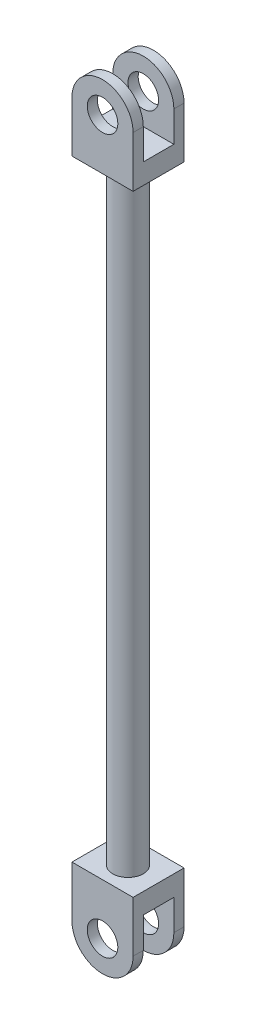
ISO-10303-21;
HEADER;
FILE_DESCRIPTION(('STEP AP214'),'2;1');
FILE_NAME('part.step','',(''),(''),'','','');
FILE_SCHEMA(('AUTOMOTIVE_DESIGN { 1 0 10303 214 1 1 1 1 }'));
ENDSEC;
DATA;
#1=APPLICATION_CONTEXT('core data for automotive mechanical design processes');
#2=APPLICATION_PROTOCOL_DEFINITION('international standard','automotive_design',2000,#1);
#3=PRODUCT_CONTEXT('',#1,'mechanical');
#4=PRODUCT('Part','Part','',(#3));
#5=PRODUCT_RELATED_PRODUCT_CATEGORY('part','',(#4));
#6=PRODUCT_DEFINITION_FORMATION('','',#4);
#7=PRODUCT_DEFINITION_CONTEXT('part definition',#1,'design');
#8=PRODUCT_DEFINITION('design','',#6,#7);
#9=PRODUCT_DEFINITION_SHAPE('','',#8);
#10=(LENGTH_UNIT() NAMED_UNIT(*) SI_UNIT(.MILLI.,.METRE.));
#11=(NAMED_UNIT(*) PLANE_ANGLE_UNIT() SI_UNIT($,.RADIAN.));
#12=(NAMED_UNIT(*) SI_UNIT($,.STERADIAN.) SOLID_ANGLE_UNIT());
#13=UNCERTAINTY_MEASURE_WITH_UNIT(LENGTH_MEASURE(1.E-05),#10,'distance_accuracy_value','');
#14=(GEOMETRIC_REPRESENTATION_CONTEXT(3) GLOBAL_UNCERTAINTY_ASSIGNED_CONTEXT((#13)) GLOBAL_UNIT_ASSIGNED_CONTEXT((#10,
#11,#12)) REPRESENTATION_CONTEXT('',''));
#15=CARTESIAN_POINT('',(0.,0.,0.));
#16=DIRECTION('',(0.,0.,1.));
#17=DIRECTION('',(1.,0.,0.));
#18=AXIS2_PLACEMENT_3D('',#15,#16,#17);
#19=CARTESIAN_POINT('',(0.,0.,1.));
#20=DIRECTION('',(0.,0.,-1.));
#21=DIRECTION('',(-1.,0.,0.));
#22=AXIS2_PLACEMENT_3D('',#19,#20,#21);
#23=CYLINDRICAL_SURFACE('',#22,3.);
#24=CARTESIAN_POINT('',(0.,0.,0.));
#25=DIRECTION('',(0.,0.,1.));
#26=DIRECTION('',(1.,0.,0.));
#27=AXIS2_PLACEMENT_3D('',#24,#25,#26);
#28=CIRCLE('',#27,3.);
#29=CARTESIAN_POINT('',(3.,0.,0.));
#30=VERTEX_POINT('',#29);
#31=CARTESIAN_POINT('',(-3.,0.,0.));
#32=VERTEX_POINT('',#31);
#33=EDGE_CURVE('E291',#30,#32,#28,.T.);
#34=ORIENTED_EDGE('',*,*,#33,.T.);
#35=DIRECTION('',(0.,0.,-1.));
#36=VECTOR('',#35,1.);
#37=CARTESIAN_POINT('',(-3.,0.,1.));
#38=LINE('',#37,#36);
#39=CARTESIAN_POINT('',(-3.,0.,1.));
#40=VERTEX_POINT('',#39);
#41=EDGE_CURVE('E243',#40,#32,#38,.T.);
#42=ORIENTED_EDGE('',*,*,#41,.F.);
#43=CARTESIAN_POINT('',(0.,0.,1.));
#44=DIRECTION('',(0.,0.,1.));
#45=DIRECTION('',(1.,0.,0.));
#46=AXIS2_PLACEMENT_3D('',#43,#44,#45);
#47=CIRCLE('',#46,3.);
#48=CARTESIAN_POINT('',(3.,0.,1.));
#49=VERTEX_POINT('',#48);
#50=EDGE_CURVE('E292',#49,#40,#47,.T.);
#51=ORIENTED_EDGE('',*,*,#50,.F.);
#52=DIRECTION('',(0.,0.,-1.));
#53=VECTOR('',#52,1.);
#54=CARTESIAN_POINT('',(3.,0.,1.));
#55=LINE('',#54,#53);
#56=EDGE_CURVE('E306',#49,#30,#55,.T.);
#57=ORIENTED_EDGE('',*,*,#56,.T.);
#58=EDGE_LOOP('',(#34,#42,#51,#57));
#59=FACE_BOUND('',#58,.T.);
#60=ADVANCED_FACE('F45',(#59),#23,.T.);
#61=CARTESIAN_POINT('',(-3.,0.,1.));
#62=DIRECTION('',(1.,0.,0.));
#63=DIRECTION('',(0.,1.,0.));
#64=AXIS2_PLACEMENT_3D('',#61,#62,#63);
#65=PLANE('',#64);
#66=DIRECTION('',(0.,-1.,0.));
#67=VECTOR('',#66,1.);
#68=CARTESIAN_POINT('',(-3.,0.,0.));
#69=LINE('',#68,#67);
#70=CARTESIAN_POINT('',(-3.,-3.,0.));
#71=VERTEX_POINT('',#70);
#72=EDGE_CURVE('E310',#32,#71,#69,.T.);
#73=ORIENTED_EDGE('',*,*,#72,.T.);
#74=DIRECTION('',(0.,0.,1.));
#75=VECTOR('',#74,1.);
#76=CARTESIAN_POINT('',(-3.,-3.,-3.));
#77=LINE('',#76,#75);
#78=CARTESIAN_POINT('',(-3.,-3.,-3.));
#79=VERTEX_POINT('',#78);
#80=EDGE_CURVE('E282',#79,#71,#77,.T.);
#81=ORIENTED_EDGE('',*,*,#80,.F.);
#82=DIRECTION('',(0.,1.,0.));
#83=VECTOR('',#82,1.);
#84=CARTESIAN_POINT('',(-3.,-5.,-3.));
#85=LINE('',#84,#83);
#86=CARTESIAN_POINT('',(-3.,0.,-3.));
#87=VERTEX_POINT('',#86);
#88=EDGE_CURVE('E249',#79,#87,#85,.T.);
#89=ORIENTED_EDGE('',*,*,#88,.T.);
#90=DIRECTION('',(0.,0.,1.));
#91=VECTOR('',#90,1.);
#92=CARTESIAN_POINT('',(-3.,0.,-4.));
#93=LINE('',#92,#91);
#94=CARTESIAN_POINT('',(-3.,0.,-4.));
#95=VERTEX_POINT('',#94);
#96=EDGE_CURVE('E260',#95,#87,#93,.T.);
#97=ORIENTED_EDGE('',*,*,#96,.F.);
#98=DIRECTION('',(0.,1.,0.));
#99=VECTOR('',#98,1.);
#100=CARTESIAN_POINT('',(-3.,-5.,-4.));
#101=LINE('',#100,#99);
#102=CARTESIAN_POINT('',(-3.,-5.,-4.));
#103=VERTEX_POINT('',#102);
#104=EDGE_CURVE('E257',#103,#95,#101,.T.);
#105=ORIENTED_EDGE('',*,*,#104,.F.);
#106=DIRECTION('',(0.,0.,-1.));
#107=VECTOR('',#106,1.);
#108=CARTESIAN_POINT('',(-3.,-5.,1.));
#109=LINE('',#108,#107);
#110=CARTESIAN_POINT('',(-3.,-5.,1.));
#111=VERTEX_POINT('',#110);
#112=EDGE_CURVE('E322',#111,#103,#109,.T.);
#113=ORIENTED_EDGE('',*,*,#112,.F.);
#114=DIRECTION('',(0.,-1.,0.));
#115=VECTOR('',#114,1.);
#116=CARTESIAN_POINT('',(-3.,0.,1.));
#117=LINE('',#116,#115);
#118=EDGE_CURVE('E296',#40,#111,#117,.T.);
#119=ORIENTED_EDGE('',*,*,#118,.F.);
#120=ORIENTED_EDGE('',*,*,#41,.T.);
#121=EDGE_LOOP('',(#73,#81,#89,#97,#105,#113,#119,#120));
#122=FACE_BOUND('',#121,.T.);
#123=ADVANCED_FACE('F448',(#122),#65,.F.);
#124=CARTESIAN_POINT('',(-3.,-5.,1.));
#125=DIRECTION('',(0.,1.,0.));
#126=DIRECTION('',(0.,0.,1.));
#127=AXIS2_PLACEMENT_3D('',#124,#125,#126);
#128=PLANE('',#127);
#129=CARTESIAN_POINT('',(0.,-5.,-1.5));
#130=DIRECTION('',(0.,-1.,0.));
#131=DIRECTION('',(0.,0.,-1.));
#132=AXIS2_PLACEMENT_3D('',#129,#130,#131);
#133=CIRCLE('',#132,1.5);
#134=CARTESIAN_POINT('',(0.,-5.,-3.));
#135=VERTEX_POINT('',#134);
#136=EDGE_CURVE('E238',#135,#135,#133,.T.);
#137=ORIENTED_EDGE('',*,*,#136,.F.);
#138=EDGE_LOOP('',(#137));
#139=FACE_BOUND('',#138,.T.);
#140=ORIENTED_EDGE('',*,*,#112,.T.);
#141=DIRECTION('',(-1.,0.,0.));
#142=VECTOR('',#141,1.);
#143=CARTESIAN_POINT('',(3.,-5.,-4.));
#144=LINE('',#143,#142);
#145=CARTESIAN_POINT('',(3.,-5.,-4.));
#146=VERTEX_POINT('',#145);
#147=EDGE_CURVE('E253',#146,#103,#144,.T.);
#148=ORIENTED_EDGE('',*,*,#147,.F.);
#149=DIRECTION('',(0.,0.,-1.));
#150=VECTOR('',#149,1.);
#151=CARTESIAN_POINT('',(3.,-5.,1.));
#152=LINE('',#151,#150);
#153=CARTESIAN_POINT('',(3.,-5.,1.));
#154=VERTEX_POINT('',#153);
#155=EDGE_CURVE('E319',#154,#146,#152,.T.);
#156=ORIENTED_EDGE('',*,*,#155,.F.);
#157=DIRECTION('',(1.,0.,0.));
#158=VECTOR('',#157,1.);
#159=CARTESIAN_POINT('',(-3.,-5.,1.));
#160=LINE('',#159,#158);
#161=EDGE_CURVE('E300',#111,#154,#160,.T.);
#162=ORIENTED_EDGE('',*,*,#161,.F.);
#163=EDGE_LOOP('',(#140,#148,#156,#162));
#164=FACE_BOUND('',#163,.T.);
#165=ADVANCED_FACE('F455',(#139,#164),#128,.F.);
#166=CARTESIAN_POINT('',(3.,-5.,1.));
#167=DIRECTION('',(-1.,0.,0.));
#168=DIRECTION('',(0.,-1.,0.));
#169=AXIS2_PLACEMENT_3D('',#166,#167,#168);
#170=PLANE('',#169);
#171=ORIENTED_EDGE('',*,*,#155,.T.);
#172=DIRECTION('',(0.,-1.,0.));
#173=VECTOR('',#172,1.);
#174=CARTESIAN_POINT('',(3.,0.,-4.));
#175=LINE('',#174,#173);
#176=CARTESIAN_POINT('',(3.,0.,-4.));
#177=VERTEX_POINT('',#176);
#178=EDGE_CURVE('E248',#177,#146,#175,.T.);
#179=ORIENTED_EDGE('',*,*,#178,.F.);
#180=DIRECTION('',(0.,0.,1.));
#181=VECTOR('',#180,1.);
#182=CARTESIAN_POINT('',(3.,0.,-4.));
#183=LINE('',#182,#181);
#184=CARTESIAN_POINT('',(3.,0.,-3.));
#185=VERTEX_POINT('',#184);
#186=EDGE_CURVE('E273',#177,#185,#183,.T.);
#187=ORIENTED_EDGE('',*,*,#186,.T.);
#188=DIRECTION('',(0.,-1.,0.));
#189=VECTOR('',#188,1.);
#190=CARTESIAN_POINT('',(3.,0.,-3.));
#191=LINE('',#190,#189);
#192=CARTESIAN_POINT('',(3.,-3.,-3.));
#193=VERTEX_POINT('',#192);
#194=EDGE_CURVE('E264',#185,#193,#191,.T.);
#195=ORIENTED_EDGE('',*,*,#194,.T.);
#196=DIRECTION('',(0.,0.,1.));
#197=VECTOR('',#196,1.);
#198=CARTESIAN_POINT('',(3.,-3.,-3.));
#199=LINE('',#198,#197);
#200=CARTESIAN_POINT('',(3.,-3.,0.));
#201=VERTEX_POINT('',#200);
#202=EDGE_CURVE('E288',#193,#201,#199,.T.);
#203=ORIENTED_EDGE('',*,*,#202,.T.);
#204=DIRECTION('',(0.,1.,0.));
#205=VECTOR('',#204,1.);
#206=CARTESIAN_POINT('',(3.,-5.,0.));
#207=LINE('',#206,#205);
#208=EDGE_CURVE('E297',#201,#30,#207,.T.);
#209=ORIENTED_EDGE('',*,*,#208,.T.);
#210=ORIENTED_EDGE('',*,*,#56,.F.);
#211=DIRECTION('',(0.,1.,0.));
#212=VECTOR('',#211,1.);
#213=CARTESIAN_POINT('',(3.,-5.,1.));
#214=LINE('',#213,#212);
#215=EDGE_CURVE('E303',#154,#49,#214,.T.);
#216=ORIENTED_EDGE('',*,*,#215,.F.);
#217=EDGE_LOOP('',(#171,#179,#187,#195,#203,#209,#210,#216));
#218=FACE_BOUND('',#217,.T.);
#219=ADVANCED_FACE('F529',(#218),#170,.F.);
#220=CARTESIAN_POINT('',(0.,0.,1.));
#221=DIRECTION('',(0.,0.,1.));
#222=DIRECTION('',(1.,0.,0.));
#223=AXIS2_PLACEMENT_3D('',#220,#221,#222);
#224=PLANE('',#223);
#225=CARTESIAN_POINT('',(0.,0.,1.));
#226=DIRECTION('',(0.,0.,1.));
#227=DIRECTION('',(1.,0.,0.));
#228=AXIS2_PLACEMENT_3D('',#225,#226,#227);
#229=CIRCLE('',#228,1.5);
#230=CARTESIAN_POINT('',(1.5,0.,1.));
#231=VERTEX_POINT('',#230);
#232=EDGE_CURVE('E377',#231,#231,#229,.T.);
#233=ORIENTED_EDGE('',*,*,#232,.F.);
#234=EDGE_LOOP('',(#233));
#235=FACE_BOUND('',#234,.T.);
#236=ORIENTED_EDGE('',*,*,#50,.T.);
#237=ORIENTED_EDGE('',*,*,#118,.T.);
#238=ORIENTED_EDGE('',*,*,#161,.T.);
#239=ORIENTED_EDGE('',*,*,#215,.T.);
#240=EDGE_LOOP('',(#236,#237,#238,#239));
#241=FACE_BOUND('',#240,.T.);
#242=ADVANCED_FACE('F566',(#235,#241),#224,.T.);
#243=CARTESIAN_POINT('',(0.,0.,0.));
#244=DIRECTION('',(0.,0.,1.));
#245=DIRECTION('',(1.,0.,0.));
#246=AXIS2_PLACEMENT_3D('',#243,#244,#245);
#247=PLANE('',#246);
#248=CARTESIAN_POINT('',(0.,0.,0.));
#249=DIRECTION('',(0.,0.,1.));
#250=DIRECTION('',(1.,0.,0.));
#251=AXIS2_PLACEMENT_3D('',#248,#249,#250);
#252=CIRCLE('',#251,1.5);
#253=CARTESIAN_POINT('',(1.5,0.,0.));
#254=VERTEX_POINT('',#253);
#255=EDGE_CURVE('E363',#254,#254,#252,.T.);
#256=ORIENTED_EDGE('',*,*,#255,.T.);
#257=EDGE_LOOP('',(#256));
#258=FACE_BOUND('',#257,.T.);
#259=ORIENTED_EDGE('',*,*,#208,.F.);
#260=DIRECTION('',(-1.,0.,0.));
#261=VECTOR('',#260,1.);
#262=CARTESIAN_POINT('',(0.,-3.,0.));
#263=LINE('',#262,#261);
#264=EDGE_CURVE('E277',#201,#71,#263,.T.);
#265=ORIENTED_EDGE('',*,*,#264,.T.);
#266=ORIENTED_EDGE('',*,*,#72,.F.);
#267=ORIENTED_EDGE('',*,*,#33,.F.);
#268=EDGE_LOOP('',(#259,#265,#266,#267));
#269=FACE_BOUND('',#268,.T.);
#270=ADVANCED_FACE('F558',(#258,#269),#247,.F.);
#271=CARTESIAN_POINT('',(0.,-3.,-3.));
#272=DIRECTION('',(0.,1.,0.));
#273=DIRECTION('',(0.,0.,1.));
#274=AXIS2_PLACEMENT_3D('',#271,#272,#273);
#275=PLANE('',#274);
#276=ORIENTED_EDGE('',*,*,#264,.F.);
#277=ORIENTED_EDGE('',*,*,#202,.F.);
#278=DIRECTION('',(-1.,0.,0.));
#279=VECTOR('',#278,1.);
#280=CARTESIAN_POINT('',(0.,-3.,-3.));
#281=LINE('',#280,#279);
#282=EDGE_CURVE('E278',#193,#79,#281,.T.);
#283=ORIENTED_EDGE('',*,*,#282,.T.);
#284=ORIENTED_EDGE('',*,*,#80,.T.);
#285=EDGE_LOOP('',(#276,#277,#283,#284));
#286=FACE_BOUND('',#285,.T.);
#287=ADVANCED_FACE('F549',(#286),#275,.T.);
#288=CARTESIAN_POINT('',(0.,0.,-3.));
#289=DIRECTION('',(0.,0.,-1.));
#290=DIRECTION('',(-1.,0.,0.));
#291=AXIS2_PLACEMENT_3D('',#288,#289,#290);
#292=PLANE('',#291);
#293=CARTESIAN_POINT('',(0.,0.,-3.));
#294=DIRECTION('',(0.,0.,-1.));
#295=DIRECTION('',(-1.,0.,0.));
#296=AXIS2_PLACEMENT_3D('',#293,#294,#295);
#297=CIRCLE('',#296,1.5);
#298=CARTESIAN_POINT('',(-1.5,0.,-3.));
#299=VERTEX_POINT('',#298);
#300=EDGE_CURVE('E388',#299,#299,#297,.T.);
#301=ORIENTED_EDGE('',*,*,#300,.T.);
#302=EDGE_LOOP('',(#301));
#303=FACE_BOUND('',#302,.T.);
#304=ORIENTED_EDGE('',*,*,#282,.F.);
#305=ORIENTED_EDGE('',*,*,#194,.F.);
#306=CARTESIAN_POINT('',(0.,0.,-3.));
#307=DIRECTION('',(0.,0.,-1.));
#308=DIRECTION('',(-1.,0.,0.));
#309=AXIS2_PLACEMENT_3D('',#306,#307,#308);
#310=CIRCLE('',#309,3.);
#311=EDGE_CURVE('E237',#87,#185,#310,.T.);
#312=ORIENTED_EDGE('',*,*,#311,.F.);
#313=ORIENTED_EDGE('',*,*,#88,.F.);
#314=EDGE_LOOP('',(#304,#305,#312,#313));
#315=FACE_BOUND('',#314,.T.);
#316=ADVANCED_FACE('F540',(#303,#315),#292,.F.);
#317=CARTESIAN_POINT('',(0.,0.,-4.));
#318=DIRECTION('',(0.,0.,1.));
#319=DIRECTION('',(1.,0.,0.));
#320=AXIS2_PLACEMENT_3D('',#317,#318,#319);
#321=CYLINDRICAL_SURFACE('',#320,3.);
#322=ORIENTED_EDGE('',*,*,#311,.T.);
#323=ORIENTED_EDGE('',*,*,#186,.F.);
#324=CARTESIAN_POINT('',(0.,0.,-4.));
#325=DIRECTION('',(0.,0.,-1.));
#326=DIRECTION('',(-1.,0.,0.));
#327=AXIS2_PLACEMENT_3D('',#324,#325,#326);
#328=CIRCLE('',#327,3.);
#329=EDGE_CURVE('E244',#95,#177,#328,.T.);
#330=ORIENTED_EDGE('',*,*,#329,.F.);
#331=ORIENTED_EDGE('',*,*,#96,.T.);
#332=EDGE_LOOP('',(#322,#323,#330,#331));
#333=FACE_BOUND('',#332,.T.);
#334=ADVANCED_FACE('F536',(#333),#321,.T.);
#335=CARTESIAN_POINT('',(0.,0.,-4.));
#336=DIRECTION('',(0.,0.,-1.));
#337=DIRECTION('',(-1.,0.,0.));
#338=AXIS2_PLACEMENT_3D('',#335,#336,#337);
#339=PLANE('',#338);
#340=CARTESIAN_POINT('',(0.,0.,-4.));
#341=DIRECTION('',(0.,0.,-1.));
#342=DIRECTION('',(-1.,0.,0.));
#343=AXIS2_PLACEMENT_3D('',#340,#341,#342);
#344=CIRCLE('',#343,1.5);
#345=CARTESIAN_POINT('',(-1.5,0.,-4.));
#346=VERTEX_POINT('',#345);
#347=EDGE_CURVE('E49',#346,#346,#344,.T.);
#348=ORIENTED_EDGE('',*,*,#347,.F.);
#349=EDGE_LOOP('',(#348));
#350=FACE_BOUND('',#349,.T.);
#351=ORIENTED_EDGE('',*,*,#329,.T.);
#352=ORIENTED_EDGE('',*,*,#178,.T.);
#353=ORIENTED_EDGE('',*,*,#147,.T.);
#354=ORIENTED_EDGE('',*,*,#104,.T.);
#355=EDGE_LOOP('',(#351,#352,#353,#354));
#356=FACE_BOUND('',#355,.T.);
#357=ADVANCED_FACE('F519',(#350,#356),#339,.T.);
#358=CARTESIAN_POINT('',(0.,-65.,-1.5));
#359=DIRECTION('',(0.,1.,0.));
#360=DIRECTION('',(0.,0.,1.));
#361=AXIS2_PLACEMENT_3D('',#358,#359,#360);
#362=CYLINDRICAL_SURFACE('',#361,1.5);
#363=CARTESIAN_POINT('',(0.,-65.,-1.5));
#364=DIRECTION('',(0.,-1.,0.));
#365=DIRECTION('',(0.,0.,-1.));
#366=AXIS2_PLACEMENT_3D('',#363,#364,#365);
#367=CIRCLE('',#366,1.5);
#368=CARTESIAN_POINT('',(0.,-65.,-3.));
#369=VERTEX_POINT('',#368);
#370=EDGE_CURVE('E233',#369,#369,#367,.T.);
#371=ORIENTED_EDGE('',*,*,#370,.F.);
#372=EDGE_LOOP('',(#371));
#373=FACE_BOUND('',#372,.T.);
#374=ORIENTED_EDGE('',*,*,#136,.T.);
#375=EDGE_LOOP('',(#374));
#376=FACE_BOUND('',#375,.T.);
#377=ADVANCED_FACE('F498',(#373,#376),#362,.T.);
#378=CARTESIAN_POINT('',(-3.,-73.,1.));
#379=DIRECTION('',(1.,0.,0.));
#380=DIRECTION('',(0.,0.,-1.));
#381=AXIS2_PLACEMENT_3D('',#378,#379,#380);
#382=PLANE('',#381);
#383=DIRECTION('',(0.,1.,0.));
#384=VECTOR('',#383,1.);
#385=CARTESIAN_POINT('',(-3.,-73.,-4.));
#386=LINE('',#385,#384);
#387=CARTESIAN_POINT('',(-3.,-70.,-4.));
#388=VERTEX_POINT('',#387);
#389=CARTESIAN_POINT('',(-3.,-65.,-4.));
#390=VERTEX_POINT('',#389);
#391=EDGE_CURVE('E230',#388,#390,#386,.T.);
#392=ORIENTED_EDGE('',*,*,#391,.F.);
#393=DIRECTION('',(0.,0.,-1.));
#394=VECTOR('',#393,1.);
#395=CARTESIAN_POINT('',(-3.,-70.,-3.));
#396=LINE('',#395,#394);
#397=CARTESIAN_POINT('',(-3.,-70.,-3.));
#398=VERTEX_POINT('',#397);
#399=EDGE_CURVE('E11',#388,#398,#396,.F.);
#400=ORIENTED_EDGE('',*,*,#399,.T.);
#401=DIRECTION('',(0.,-1.,0.));
#402=VECTOR('',#401,1.);
#403=CARTESIAN_POINT('',(-3.,-67.,-3.));
#404=LINE('',#403,#402);
#405=CARTESIAN_POINT('',(-3.,-67.,-3.));
#406=VERTEX_POINT('',#405);
#407=EDGE_CURVE('E199',#406,#398,#404,.T.);
#408=ORIENTED_EDGE('',*,*,#407,.F.);
#409=DIRECTION('',(0.,0.,-1.));
#410=VECTOR('',#409,1.);
#411=CARTESIAN_POINT('',(-3.,-67.,-3.));
#412=LINE('',#411,#410);
#413=CARTESIAN_POINT('',(-3.,-67.,0.));
#414=VERTEX_POINT('',#413);
#415=EDGE_CURVE('E177',#414,#406,#412,.T.);
#416=ORIENTED_EDGE('',*,*,#415,.F.);
#417=DIRECTION('',(0.,-1.,0.));
#418=VECTOR('',#417,1.);
#419=CARTESIAN_POINT('',(-3.,-67.,0.));
#420=LINE('',#419,#418);
#421=CARTESIAN_POINT('',(-3.,-70.,0.));
#422=VERTEX_POINT('',#421);
#423=EDGE_CURVE('E173',#414,#422,#420,.T.);
#424=ORIENTED_EDGE('',*,*,#423,.T.);
#425=DIRECTION('',(0.,0.,-1.));
#426=VECTOR('',#425,1.);
#427=CARTESIAN_POINT('',(-3.,-70.,1.));
#428=LINE('',#427,#426);
#429=CARTESIAN_POINT('',(-3.,-70.,1.));
#430=VERTEX_POINT('',#429);
#431=EDGE_CURVE('E55',#422,#430,#428,.F.);
#432=ORIENTED_EDGE('',*,*,#431,.T.);
#433=DIRECTION('',(0.,1.,0.));
#434=VECTOR('',#433,1.);
#435=CARTESIAN_POINT('',(-3.,-73.,1.));
#436=LINE('',#435,#434);
#437=CARTESIAN_POINT('',(-3.,-65.,1.));
#438=VERTEX_POINT('',#437);
#439=EDGE_CURVE('E221',#430,#438,#436,.T.);
#440=ORIENTED_EDGE('',*,*,#439,.T.);
#441=DIRECTION('',(0.,0.,-1.));
#442=VECTOR('',#441,1.);
#443=CARTESIAN_POINT('',(-3.,-65.,1.));
#444=LINE('',#443,#442);
#445=EDGE_CURVE('E204',#438,#390,#444,.T.);
#446=ORIENTED_EDGE('',*,*,#445,.T.);
#447=EDGE_LOOP('',(#392,#400,#408,#416,#424,#432,#440,#446));
#448=FACE_BOUND('',#447,.T.);
#449=ADVANCED_FACE('F433',(#448),#382,.F.);
#450=CARTESIAN_POINT('',(-3.,-73.,-4.));
#451=DIRECTION('',(0.,0.,1.));
#452=DIRECTION('',(1.,0.,0.));
#453=AXIS2_PLACEMENT_3D('',#450,#451,#452);
#454=PLANE('',#453);
#455=CARTESIAN_POINT('',(0.,-70.,-4.));
#456=DIRECTION('',(0.,0.,1.));
#457=DIRECTION('',(1.,0.,0.));
#458=AXIS2_PLACEMENT_3D('',#455,#456,#457);
#459=CIRCLE('',#458,1.5);
#460=CARTESIAN_POINT('',(1.5,-70.,-4.));
#461=VERTEX_POINT('',#460);
#462=EDGE_CURVE('E374',#461,#461,#459,.T.);
#463=ORIENTED_EDGE('',*,*,#462,.T.);
#464=EDGE_LOOP('',(#463));
#465=FACE_BOUND('',#464,.T.);
#466=DIRECTION('',(0.,1.,0.));
#467=VECTOR('',#466,1.);
#468=CARTESIAN_POINT('',(3.,-73.,-4.));
#469=LINE('',#468,#467);
#470=CARTESIAN_POINT('',(3.,-70.,-4.));
#471=VERTEX_POINT('',#470);
#472=CARTESIAN_POINT('',(3.,-65.,-4.));
#473=VERTEX_POINT('',#472);
#474=EDGE_CURVE('E227',#471,#473,#469,.T.);
#475=ORIENTED_EDGE('',*,*,#474,.F.);
#476=CARTESIAN_POINT('',(0.,-70.,-4.));
#477=DIRECTION('',(0.,0.,1.));
#478=DIRECTION('',(1.,0.,0.));
#479=AXIS2_PLACEMENT_3D('',#476,#477,#478);
#480=CIRCLE('',#479,3.);
#481=CARTESIAN_POINT('',(0.,-73.,-4.));
#482=VERTEX_POINT('',#481);
#483=EDGE_CURVE('E342',#471,#482,#480,.F.);
#484=ORIENTED_EDGE('',*,*,#483,.T.);
#485=CARTESIAN_POINT('',(0.,-70.,-4.));
#486=DIRECTION('',(0.,0.,1.));
#487=DIRECTION('',(1.,0.,0.));
#488=AXIS2_PLACEMENT_3D('',#485,#486,#487);
#489=CIRCLE('',#488,3.);
#490=EDGE_CURVE('E339',#482,#388,#489,.F.);
#491=ORIENTED_EDGE('',*,*,#490,.T.);
#492=ORIENTED_EDGE('',*,*,#391,.T.);
#493=DIRECTION('',(1.,0.,0.));
#494=VECTOR('',#493,1.);
#495=CARTESIAN_POINT('',(-3.,-65.,-4.));
#496=LINE('',#495,#494);
#497=EDGE_CURVE('E208',#390,#473,#496,.T.);
#498=ORIENTED_EDGE('',*,*,#497,.T.);
#499=EDGE_LOOP('',(#475,#484,#491,#492,#498));
#500=FACE_BOUND('',#499,.T.);
#501=ADVANCED_FACE('F416',(#465,#500),#454,.F.);
#502=CARTESIAN_POINT('',(3.,-73.,1.));
#503=DIRECTION('',(-1.,0.,0.));
#504=DIRECTION('',(0.,0.,1.));
#505=AXIS2_PLACEMENT_3D('',#502,#503,#504);
#506=PLANE('',#505);
#507=DIRECTION('',(0.,-1.,0.));
#508=VECTOR('',#507,1.);
#509=CARTESIAN_POINT('',(3.,-67.,-3.));
#510=LINE('',#509,#508);
#511=CARTESIAN_POINT('',(3.,-67.,-3.));
#512=VERTEX_POINT('',#511);
#513=CARTESIAN_POINT('',(3.,-70.,-3.));
#514=VERTEX_POINT('',#513);
#515=EDGE_CURVE('E209',#512,#514,#510,.T.);
#516=ORIENTED_EDGE('',*,*,#515,.T.);
#517=DIRECTION('',(0.,0.,1.));
#518=VECTOR('',#517,1.);
#519=CARTESIAN_POINT('',(3.,-70.,-4.));
#520=LINE('',#519,#518);
#521=EDGE_CURVE('E335',#514,#471,#520,.F.);
#522=ORIENTED_EDGE('',*,*,#521,.T.);
#523=ORIENTED_EDGE('',*,*,#474,.T.);
#524=DIRECTION('',(0.,0.,1.));
#525=VECTOR('',#524,1.);
#526=CARTESIAN_POINT('',(3.,-65.,1.));
#527=LINE('',#526,#525);
#528=CARTESIAN_POINT('',(3.,-65.,1.));
#529=VERTEX_POINT('',#528);
#530=EDGE_CURVE('E213',#473,#529,#527,.T.);
#531=ORIENTED_EDGE('',*,*,#530,.T.);
#532=DIRECTION('',(0.,1.,0.));
#533=VECTOR('',#532,1.);
#534=CARTESIAN_POINT('',(3.,-73.,1.));
#535=LINE('',#534,#533);
#536=CARTESIAN_POINT('',(3.,-70.,1.));
#537=VERTEX_POINT('',#536);
#538=EDGE_CURVE('E224',#537,#529,#535,.T.);
#539=ORIENTED_EDGE('',*,*,#538,.F.);
#540=DIRECTION('',(0.,0.,1.));
#541=VECTOR('',#540,1.);
#542=CARTESIAN_POINT('',(3.,-70.,0.));
#543=LINE('',#542,#541);
#544=CARTESIAN_POINT('',(3.,-70.,0.));
#545=VERTEX_POINT('',#544);
#546=EDGE_CURVE('E194',#537,#545,#543,.F.);
#547=ORIENTED_EDGE('',*,*,#546,.T.);
#548=DIRECTION('',(0.,-1.,0.));
#549=VECTOR('',#548,1.);
#550=CARTESIAN_POINT('',(3.,-67.,0.));
#551=LINE('',#550,#549);
#552=CARTESIAN_POINT('',(3.,-67.,0.));
#553=VERTEX_POINT('',#552);
#554=EDGE_CURVE('E172',#553,#545,#551,.T.);
#555=ORIENTED_EDGE('',*,*,#554,.F.);
#556=DIRECTION('',(0.,0.,1.));
#557=VECTOR('',#556,1.);
#558=CARTESIAN_POINT('',(3.,-67.,-3.));
#559=LINE('',#558,#557);
#560=EDGE_CURVE('E178',#512,#553,#559,.T.);
#561=ORIENTED_EDGE('',*,*,#560,.F.);
#562=EDGE_LOOP('',(#516,#522,#523,#531,#539,#547,#555,#561));
#563=FACE_BOUND('',#562,.T.);
#564=ADVANCED_FACE('F191',(#563),#506,.F.);
#565=CARTESIAN_POINT('',(-3.,-73.,1.));
#566=DIRECTION('',(0.,0.,-1.));
#567=DIRECTION('',(-1.,0.,0.));
#568=AXIS2_PLACEMENT_3D('',#565,#566,#567);
#569=PLANE('',#568);
#570=CARTESIAN_POINT('',(0.,-70.,1.));
#571=DIRECTION('',(0.,0.,1.));
#572=DIRECTION('',(1.,0.,0.));
#573=AXIS2_PLACEMENT_3D('',#570,#571,#572);
#574=CIRCLE('',#573,1.5);
#575=CARTESIAN_POINT('',(1.5,-70.,1.));
#576=VERTEX_POINT('',#575);
#577=EDGE_CURVE('E368',#576,#576,#574,.T.);
#578=ORIENTED_EDGE('',*,*,#577,.F.);
#579=EDGE_LOOP('',(#578));
#580=FACE_BOUND('',#579,.T.);
#581=CARTESIAN_POINT('',(0.,-70.,1.));
#582=DIRECTION('',(0.,0.,-1.));
#583=DIRECTION('',(-1.,0.,0.));
#584=AXIS2_PLACEMENT_3D('',#581,#582,#583);
#585=CIRCLE('',#584,3.);
#586=CARTESIAN_POINT('',(0.,-73.,1.));
#587=VERTEX_POINT('',#586);
#588=EDGE_CURVE('E345',#430,#587,#585,.F.);
#589=ORIENTED_EDGE('',*,*,#588,.T.);
#590=CARTESIAN_POINT('',(0.,-70.,1.));
#591=DIRECTION('',(0.,0.,-1.));
#592=DIRECTION('',(-1.,0.,0.));
#593=AXIS2_PLACEMENT_3D('',#590,#591,#592);
#594=CIRCLE('',#593,3.);
#595=EDGE_CURVE('E348',#587,#537,#594,.F.);
#596=ORIENTED_EDGE('',*,*,#595,.T.);
#597=ORIENTED_EDGE('',*,*,#538,.T.);
#598=DIRECTION('',(-1.,0.,0.));
#599=VECTOR('',#598,1.);
#600=CARTESIAN_POINT('',(-3.,-65.,1.));
#601=LINE('',#600,#599);
#602=EDGE_CURVE('E217',#529,#438,#601,.T.);
#603=ORIENTED_EDGE('',*,*,#602,.T.);
#604=ORIENTED_EDGE('',*,*,#439,.F.);
#605=EDGE_LOOP('',(#589,#596,#597,#603,#604));
#606=FACE_BOUND('',#605,.T.);
#607=ADVANCED_FACE('F434',(#580,#606),#569,.F.);
#608=CARTESIAN_POINT('',(0.,-65.,0.));
#609=DIRECTION('',(0.,-1.,0.));
#610=DIRECTION('',(0.,0.,-1.));
#611=AXIS2_PLACEMENT_3D('',#608,#609,#610);
#612=PLANE('',#611);
#613=ORIENTED_EDGE('',*,*,#370,.T.);
#614=EDGE_LOOP('',(#613));
#615=FACE_BOUND('',#614,.T.);
#616=ORIENTED_EDGE('',*,*,#445,.F.);
#617=ORIENTED_EDGE('',*,*,#602,.F.);
#618=ORIENTED_EDGE('',*,*,#530,.F.);
#619=ORIENTED_EDGE('',*,*,#497,.F.);
#620=EDGE_LOOP('',(#616,#617,#618,#619));
#621=FACE_BOUND('',#620,.T.);
#622=ADVANCED_FACE('F423',(#615,#621),#612,.F.);
#623=CARTESIAN_POINT('',(-3.,-67.,-3.));
#624=DIRECTION('',(0.,0.,-1.));
#625=DIRECTION('',(-1.,0.,0.));
#626=AXIS2_PLACEMENT_3D('',#623,#624,#625);
#627=PLANE('',#626);
#628=CARTESIAN_POINT('',(0.,-70.,-3.));
#629=DIRECTION('',(0.,0.,-1.));
#630=DIRECTION('',(-1.,0.,0.));
#631=AXIS2_PLACEMENT_3D('',#628,#629,#630);
#632=CIRCLE('',#631,1.5);
#633=CARTESIAN_POINT('',(-1.5,-70.,-3.));
#634=VERTEX_POINT('',#633);
#635=EDGE_CURVE('E367',#634,#634,#632,.T.);
#636=ORIENTED_EDGE('',*,*,#635,.T.);
#637=EDGE_LOOP('',(#636));
#638=FACE_BOUND('',#637,.T.);
#639=CARTESIAN_POINT('',(0.,-70.,-3.));
#640=DIRECTION('',(0.,0.,-1.));
#641=DIRECTION('',(-1.,0.,0.));
#642=AXIS2_PLACEMENT_3D('',#639,#640,#641);
#643=CIRCLE('',#642,3.);
#644=CARTESIAN_POINT('',(0.,-73.,-3.));
#645=VERTEX_POINT('',#644);
#646=EDGE_CURVE('E242',#398,#645,#643,.F.);
#647=ORIENTED_EDGE('',*,*,#646,.T.);
#648=CARTESIAN_POINT('',(0.,-70.,-3.));
#649=DIRECTION('',(0.,0.,-1.));
#650=DIRECTION('',(-1.,0.,0.));
#651=AXIS2_PLACEMENT_3D('',#648,#649,#650);
#652=CIRCLE('',#651,3.);
#653=EDGE_CURVE('E330',#645,#514,#652,.F.);
#654=ORIENTED_EDGE('',*,*,#653,.T.);
#655=ORIENTED_EDGE('',*,*,#515,.F.);
#656=DIRECTION('',(1.,0.,0.));
#657=VECTOR('',#656,1.);
#658=CARTESIAN_POINT('',(-3.,-67.,-3.));
#659=LINE('',#658,#657);
#660=EDGE_CURVE('E184',#406,#512,#659,.T.);
#661=ORIENTED_EDGE('',*,*,#660,.F.);
#662=ORIENTED_EDGE('',*,*,#407,.T.);
#663=EDGE_LOOP('',(#647,#654,#655,#661,#662));
#664=FACE_BOUND('',#663,.T.);
#665=ADVANCED_FACE('F403',(#638,#664),#627,.F.);
#666=CARTESIAN_POINT('',(-3.,-67.,0.));
#667=DIRECTION('',(0.,0.,1.));
#668=DIRECTION('',(1.,0.,0.));
#669=AXIS2_PLACEMENT_3D('',#666,#667,#668);
#670=PLANE('',#669);
#671=CARTESIAN_POINT('',(0.,-70.,0.));
#672=DIRECTION('',(0.,0.,1.));
#673=DIRECTION('',(1.,0.,0.));
#674=AXIS2_PLACEMENT_3D('',#671,#672,#673);
#675=CIRCLE('',#674,1.5);
#676=CARTESIAN_POINT('',(1.5,-70.,0.));
#677=VERTEX_POINT('',#676);
#678=EDGE_CURVE('E364',#677,#677,#675,.T.);
#679=ORIENTED_EDGE('',*,*,#678,.T.);
#680=EDGE_LOOP('',(#679));
#681=FACE_BOUND('',#680,.T.);
#682=ORIENTED_EDGE('',*,*,#554,.T.);
#683=CARTESIAN_POINT('',(0.,-70.,0.));
#684=DIRECTION('',(0.,0.,1.));
#685=DIRECTION('',(1.,0.,0.));
#686=AXIS2_PLACEMENT_3D('',#683,#684,#685);
#687=CIRCLE('',#686,3.);
#688=CARTESIAN_POINT('',(0.,-73.,0.));
#689=VERTEX_POINT('',#688);
#690=EDGE_CURVE('E68',#545,#689,#687,.F.);
#691=ORIENTED_EDGE('',*,*,#690,.T.);
#692=CARTESIAN_POINT('',(0.,-70.,0.));
#693=DIRECTION('',(0.,0.,1.));
#694=DIRECTION('',(1.,0.,0.));
#695=AXIS2_PLACEMENT_3D('',#692,#693,#694);
#696=CIRCLE('',#695,3.);
#697=EDGE_CURVE('E63',#689,#422,#696,.F.);
#698=ORIENTED_EDGE('',*,*,#697,.T.);
#699=ORIENTED_EDGE('',*,*,#423,.F.);
#700=DIRECTION('',(-1.,0.,0.));
#701=VECTOR('',#700,1.);
#702=CARTESIAN_POINT('',(-3.,-67.,0.));
#703=LINE('',#702,#701);
#704=EDGE_CURVE('E168',#553,#414,#703,.T.);
#705=ORIENTED_EDGE('',*,*,#704,.F.);
#706=EDGE_LOOP('',(#682,#691,#698,#699,#705));
#707=FACE_BOUND('',#706,.T.);
#708=ADVANCED_FACE('F170',(#681,#707),#670,.F.);
#709=CARTESIAN_POINT('',(0.,-67.,0.));
#710=DIRECTION('',(0.,1.,0.));
#711=DIRECTION('',(0.,0.,1.));
#712=AXIS2_PLACEMENT_3D('',#709,#710,#711);
#713=PLANE('',#712);
#714=ORIENTED_EDGE('',*,*,#560,.T.);
#715=ORIENTED_EDGE('',*,*,#704,.T.);
#716=ORIENTED_EDGE('',*,*,#415,.T.);
#717=ORIENTED_EDGE('',*,*,#660,.T.);
#718=EDGE_LOOP('',(#714,#715,#716,#717));
#719=FACE_BOUND('',#718,.T.);
#720=ADVANCED_FACE('F182',(#719),#713,.F.);
#721=CARTESIAN_POINT('',(0.,-70.,0.));
#722=DIRECTION('',(0.,0.,1.));
#723=DIRECTION('',(1.,0.,0.));
#724=AXIS2_PLACEMENT_3D('',#721,#722,#723);
#725=CYLINDRICAL_SURFACE('',#724,3.);
#726=ORIENTED_EDGE('',*,*,#399,.F.);
#727=ORIENTED_EDGE('',*,*,#490,.F.);
#728=DIRECTION('',(0.,0.,-1.));
#729=VECTOR('',#728,1.);
#730=CARTESIAN_POINT('',(0.,-73.,-4.));
#731=LINE('',#730,#729);
#732=EDGE_CURVE('E188',#645,#482,#731,.T.);
#733=ORIENTED_EDGE('',*,*,#732,.F.);
#734=ORIENTED_EDGE('',*,*,#646,.F.);
#735=EDGE_LOOP('',(#726,#727,#733,#734));
#736=FACE_BOUND('',#735,.T.);
#737=ADVANCED_FACE('F408',(#736),#725,.T.);
#738=CARTESIAN_POINT('',(0.,-70.,0.));
#739=DIRECTION('',(0.,0.,-1.));
#740=DIRECTION('',(-1.,0.,0.));
#741=AXIS2_PLACEMENT_3D('',#738,#739,#740);
#742=CYLINDRICAL_SURFACE('',#741,3.);
#743=ORIENTED_EDGE('',*,*,#483,.F.);
#744=ORIENTED_EDGE('',*,*,#521,.F.);
#745=ORIENTED_EDGE('',*,*,#653,.F.);
#746=ORIENTED_EDGE('',*,*,#732,.T.);
#747=EDGE_LOOP('',(#743,#744,#745,#746));
#748=FACE_BOUND('',#747,.T.);
#749=ADVANCED_FACE('F413',(#748),#742,.T.);
#750=CARTESIAN_POINT('',(0.,-70.,0.));
#751=DIRECTION('',(0.,0.,1.));
#752=DIRECTION('',(1.,0.,0.));
#753=AXIS2_PLACEMENT_3D('',#750,#751,#752);
#754=CYLINDRICAL_SURFACE('',#753,3.);
#755=ORIENTED_EDGE('',*,*,#431,.F.);
#756=ORIENTED_EDGE('',*,*,#697,.F.);
#757=DIRECTION('',(0.,0.,-1.));
#758=VECTOR('',#757,1.);
#759=CARTESIAN_POINT('',(0.,-73.,0.));
#760=LINE('',#759,#758);
#761=EDGE_CURVE('E360',#587,#689,#760,.T.);
#762=ORIENTED_EDGE('',*,*,#761,.F.);
#763=ORIENTED_EDGE('',*,*,#588,.F.);
#764=EDGE_LOOP('',(#755,#756,#762,#763));
#765=FACE_BOUND('',#764,.T.);
#766=ADVANCED_FACE('F47',(#765),#754,.T.);
#767=CARTESIAN_POINT('',(0.,-70.,0.));
#768=DIRECTION('',(0.,0.,-1.));
#769=DIRECTION('',(-1.,0.,0.));
#770=AXIS2_PLACEMENT_3D('',#767,#768,#769);
#771=CYLINDRICAL_SURFACE('',#770,3.);
#772=ORIENTED_EDGE('',*,*,#690,.F.);
#773=ORIENTED_EDGE('',*,*,#546,.F.);
#774=ORIENTED_EDGE('',*,*,#595,.F.);
#775=ORIENTED_EDGE('',*,*,#761,.T.);
#776=EDGE_LOOP('',(#772,#773,#774,#775));
#777=FACE_BOUND('',#776,.T.);
#778=ADVANCED_FACE('F427',(#777),#771,.T.);
#779=CARTESIAN_POINT('',(0.,-70.,-5.));
#780=DIRECTION('',(0.,0.,1.));
#781=DIRECTION('',(1.,0.,0.));
#782=AXIS2_PLACEMENT_3D('',#779,#780,#781);
#783=CYLINDRICAL_SURFACE('',#782,1.5);
#784=ORIENTED_EDGE('',*,*,#577,.T.);
#785=EDGE_LOOP('',(#784));
#786=FACE_BOUND('',#785,.T.);
#787=ORIENTED_EDGE('',*,*,#678,.F.);
#788=EDGE_LOOP('',(#787));
#789=FACE_BOUND('',#788,.T.);
#790=ADVANCED_FACE('F464',(#786,#789),#783,.F.);
#791=ORIENTED_EDGE('',*,*,#635,.F.);
#792=EDGE_LOOP('',(#791));
#793=FACE_BOUND('',#792,.T.);
#794=ORIENTED_EDGE('',*,*,#462,.F.);
#795=EDGE_LOOP('',(#794));
#796=FACE_BOUND('',#795,.T.);
#797=ADVANCED_FACE('F470',(#793,#796),#783,.F.);
#798=CARTESIAN_POINT('',(0.,0.,-5.));
#799=DIRECTION('',(0.,0.,1.));
#800=DIRECTION('',(1.,0.,0.));
#801=AXIS2_PLACEMENT_3D('',#798,#799,#800);
#802=CYLINDRICAL_SURFACE('',#801,1.5);
#803=ORIENTED_EDGE('',*,*,#347,.T.);
#804=EDGE_LOOP('',(#803));
#805=FACE_BOUND('',#804,.T.);
#806=ORIENTED_EDGE('',*,*,#300,.F.);
#807=EDGE_LOOP('',(#806));
#808=FACE_BOUND('',#807,.T.);
#809=ADVANCED_FACE('F631',(#805,#808),#802,.F.);
#810=ORIENTED_EDGE('',*,*,#232,.T.);
#811=EDGE_LOOP('',(#810));
#812=FACE_BOUND('',#811,.T.);
#813=ORIENTED_EDGE('',*,*,#255,.F.);
#814=EDGE_LOOP('',(#813));
#815=FACE_BOUND('',#814,.T.);
#816=ADVANCED_FACE('F636',(#812,#815),#802,.F.);
#817=CLOSED_SHELL('',(#60,#123,#165,#219,#242,#270,#287,#316,#334,#357,#377,#449,#501,#564,#607,
#622,#665,#708,#720,#737,#749,#766,#778,#790,#797,#809,#816));
#818=MANIFOLD_SOLID_BREP('B2',#817);
#819=ADVANCED_BREP_SHAPE_REPRESENTATION('',(#18,#818),#14);
#820=SHAPE_DEFINITION_REPRESENTATION(#9,#819);
ENDSEC;
END-ISO-10303-21;
